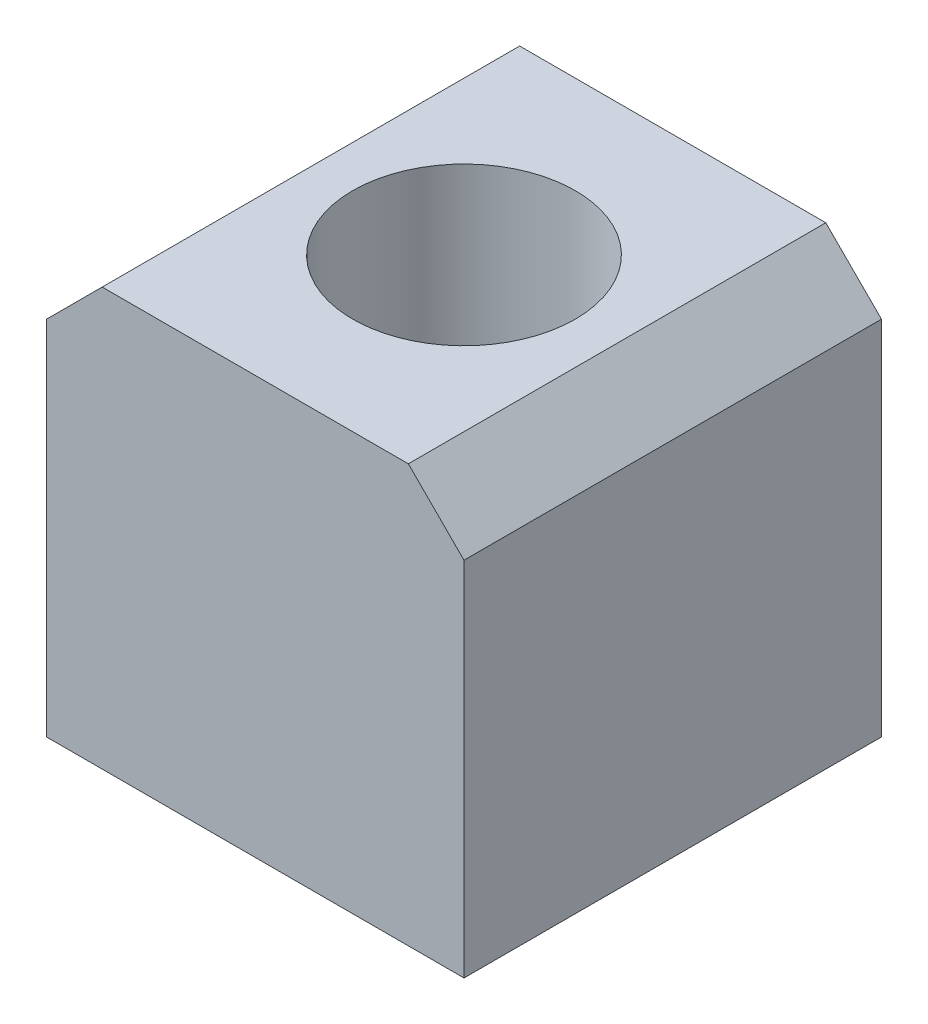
ISO-10303-21;
HEADER;
FILE_DESCRIPTION(('STEP AP214'),'2;1');
FILE_NAME('part.step','',(''),(''),'','','');
FILE_SCHEMA(('AUTOMOTIVE_DESIGN { 1 0 10303 214 1 1 1 1 }'));
ENDSEC;
DATA;
#1=APPLICATION_CONTEXT('core data for automotive mechanical design processes');
#2=APPLICATION_PROTOCOL_DEFINITION('international standard','automotive_design',2000,#1);
#3=PRODUCT_CONTEXT('',#1,'mechanical');
#4=PRODUCT('Part','Part','',(#3));
#5=PRODUCT_RELATED_PRODUCT_CATEGORY('part','',(#4));
#6=PRODUCT_DEFINITION_FORMATION('','',#4);
#7=PRODUCT_DEFINITION_CONTEXT('part definition',#1,'design');
#8=PRODUCT_DEFINITION('design','',#6,#7);
#9=PRODUCT_DEFINITION_SHAPE('','',#8);
#10=(LENGTH_UNIT() NAMED_UNIT(*) SI_UNIT(.MILLI.,.METRE.));
#11=(NAMED_UNIT(*) PLANE_ANGLE_UNIT() SI_UNIT($,.RADIAN.));
#12=(NAMED_UNIT(*) SI_UNIT($,.STERADIAN.) SOLID_ANGLE_UNIT());
#13=UNCERTAINTY_MEASURE_WITH_UNIT(LENGTH_MEASURE(1.E-05),#10,'distance_accuracy_value','');
#14=(GEOMETRIC_REPRESENTATION_CONTEXT(3) GLOBAL_UNCERTAINTY_ASSIGNED_CONTEXT((#13)) GLOBAL_UNIT_ASSIGNED_CONTEXT((#10,
#11,#12)) REPRESENTATION_CONTEXT('',''));
#15=CARTESIAN_POINT('',(0.,0.,0.));
#16=DIRECTION('',(0.,0.,1.));
#17=DIRECTION('',(1.,0.,0.));
#18=AXIS2_PLACEMENT_3D('',#15,#16,#17);
#19=CARTESIAN_POINT('',(-7.5,7.5,-7.5));
#20=DIRECTION('',(-1.,0.,0.));
#21=DIRECTION('',(0.,-1.,0.));
#22=AXIS2_PLACEMENT_3D('',#19,#20,#21);
#23=PLANE('',#22);
#24=DIRECTION('',(0.,-1.,0.));
#25=VECTOR('',#24,1.);
#26=CARTESIAN_POINT('',(-7.5,7.5,7.5));
#27=LINE('',#26,#25);
#28=CARTESIAN_POINT('',(-7.5,5.49999999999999,7.5));
#29=VERTEX_POINT('',#28);
#30=CARTESIAN_POINT('',(-7.5,-7.5,7.5));
#31=VERTEX_POINT('',#30);
#32=EDGE_CURVE('E100',#29,#31,#27,.T.);
#33=ORIENTED_EDGE('',*,*,#32,.F.);
#34=DIRECTION('',(0.,0.,-1.));
#35=VECTOR('',#34,1.);
#36=CARTESIAN_POINT('',(-7.5,5.49999999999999,-7.5));
#37=LINE('',#36,#35);
#38=CARTESIAN_POINT('',(-7.5,5.49999999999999,-7.5));
#39=VERTEX_POINT('',#38);
#40=EDGE_CURVE('E68',#29,#39,#37,.T.);
#41=ORIENTED_EDGE('',*,*,#40,.T.);
#42=DIRECTION('',(0.,-1.,0.));
#43=VECTOR('',#42,1.);
#44=CARTESIAN_POINT('',(-7.5,7.5,-7.5));
#45=LINE('',#44,#43);
#46=CARTESIAN_POINT('',(-7.5,-7.5,-7.5));
#47=VERTEX_POINT('',#46);
#48=EDGE_CURVE('E112',#39,#47,#45,.T.);
#49=ORIENTED_EDGE('',*,*,#48,.T.);
#50=DIRECTION('',(0.,0.,1.));
#51=VECTOR('',#50,1.);
#52=CARTESIAN_POINT('',(-7.5,-7.5,-7.5));
#53=LINE('',#52,#51);
#54=EDGE_CURVE('E111',#47,#31,#53,.T.);
#55=ORIENTED_EDGE('',*,*,#54,.T.);
#56=EDGE_LOOP('',(#33,#41,#49,#55));
#57=FACE_BOUND('',#56,.T.);
#58=ADVANCED_FACE('F44',(#57),#23,.T.);
#59=CARTESIAN_POINT('',(7.5,7.5,-7.5));
#60=DIRECTION('',(0.,1.,0.));
#61=DIRECTION('',(-1.,0.,0.));
#62=AXIS2_PLACEMENT_3D('',#59,#60,#61);
#63=PLANE('',#62);
#64=CARTESIAN_POINT('',(0.,7.5,0.));
#65=DIRECTION('',(0.,1.,0.));
#66=DIRECTION('',(-1.,0.,0.));
#67=AXIS2_PLACEMENT_3D('',#64,#65,#66);
#68=CIRCLE('',#67,4.);
#69=CARTESIAN_POINT('',(-4.,7.5,0.));
#70=VERTEX_POINT('',#69);
#71=EDGE_CURVE('E188',#70,#70,#68,.T.);
#72=ORIENTED_EDGE('',*,*,#71,.F.);
#73=EDGE_LOOP('',(#72));
#74=FACE_BOUND('',#73,.T.);
#75=DIRECTION('',(-1.,0.,0.));
#76=VECTOR('',#75,1.);
#77=CARTESIAN_POINT('',(7.5,7.5,-7.5));
#78=LINE('',#77,#76);
#79=CARTESIAN_POINT('',(5.49999999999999,7.5,-7.5));
#80=VERTEX_POINT('',#79);
#81=CARTESIAN_POINT('',(-5.49999999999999,7.5,-7.5));
#82=VERTEX_POINT('',#81);
#83=EDGE_CURVE('E117',#80,#82,#78,.T.);
#84=ORIENTED_EDGE('',*,*,#83,.T.);
#85=DIRECTION('',(0.,0.,1.));
#86=VECTOR('',#85,1.);
#87=CARTESIAN_POINT('',(-5.5,7.5,-7.5));
#88=LINE('',#87,#86);
#89=CARTESIAN_POINT('',(-5.49999999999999,7.5,7.5));
#90=VERTEX_POINT('',#89);
#91=EDGE_CURVE('E137',#82,#90,#88,.T.);
#92=ORIENTED_EDGE('',*,*,#91,.T.);
#93=DIRECTION('',(-1.,0.,0.));
#94=VECTOR('',#93,1.);
#95=CARTESIAN_POINT('',(7.5,7.5,7.5));
#96=LINE('',#95,#94);
#97=CARTESIAN_POINT('',(5.49999999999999,7.5,7.5));
#98=VERTEX_POINT('',#97);
#99=EDGE_CURVE('E122',#98,#90,#96,.T.);
#100=ORIENTED_EDGE('',*,*,#99,.F.);
#101=DIRECTION('',(0.,0.,-1.));
#102=VECTOR('',#101,1.);
#103=CARTESIAN_POINT('',(5.49999999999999,7.5,-7.5));
#104=LINE('',#103,#102);
#105=EDGE_CURVE('E134',#98,#80,#104,.T.);
#106=ORIENTED_EDGE('',*,*,#105,.T.);
#107=EDGE_LOOP('',(#84,#92,#100,#106));
#108=FACE_BOUND('',#107,.T.);
#109=ADVANCED_FACE('F150',(#74,#108),#63,.T.);
#110=CARTESIAN_POINT('',(7.5,7.5,-7.5));
#111=DIRECTION('',(1.,0.,0.));
#112=DIRECTION('',(0.,1.,0.));
#113=AXIS2_PLACEMENT_3D('',#110,#111,#112);
#114=PLANE('',#113);
#115=DIRECTION('',(0.,1.,0.));
#116=VECTOR('',#115,1.);
#117=CARTESIAN_POINT('',(7.5,7.5,-7.5));
#118=LINE('',#117,#116);
#119=CARTESIAN_POINT('',(7.5,-7.5,-7.5));
#120=VERTEX_POINT('',#119);
#121=CARTESIAN_POINT('',(7.5,5.5,-7.5));
#122=VERTEX_POINT('',#121);
#123=EDGE_CURVE('E130',#120,#122,#118,.T.);
#124=ORIENTED_EDGE('',*,*,#123,.T.);
#125=DIRECTION('',(0.,0.,1.));
#126=VECTOR('',#125,1.);
#127=CARTESIAN_POINT('',(7.5,5.5,-7.5));
#128=LINE('',#127,#126);
#129=CARTESIAN_POINT('',(7.5,5.5,7.5));
#130=VERTEX_POINT('',#129);
#131=EDGE_CURVE('E13',#122,#130,#128,.T.);
#132=ORIENTED_EDGE('',*,*,#131,.T.);
#133=DIRECTION('',(0.,1.,0.));
#134=VECTOR('',#133,1.);
#135=CARTESIAN_POINT('',(7.5,7.5,7.5));
#136=LINE('',#135,#134);
#137=CARTESIAN_POINT('',(7.5,-7.5,7.5));
#138=VERTEX_POINT('',#137);
#139=EDGE_CURVE('E120',#138,#130,#136,.T.);
#140=ORIENTED_EDGE('',*,*,#139,.F.);
#141=DIRECTION('',(0.,0.,1.));
#142=VECTOR('',#141,1.);
#143=CARTESIAN_POINT('',(7.5,-7.5,-7.5));
#144=LINE('',#143,#142);
#145=EDGE_CURVE('E116',#120,#138,#144,.T.);
#146=ORIENTED_EDGE('',*,*,#145,.F.);
#147=EDGE_LOOP('',(#124,#132,#140,#146));
#148=FACE_BOUND('',#147,.T.);
#149=ADVANCED_FACE('F167',(#148),#114,.T.);
#150=CARTESIAN_POINT('',(7.5,-7.5,-7.5));
#151=DIRECTION('',(0.,-1.,0.));
#152=DIRECTION('',(1.,0.,0.));
#153=AXIS2_PLACEMENT_3D('',#150,#151,#152);
#154=PLANE('',#153);
#155=CARTESIAN_POINT('',(0.,-7.5,0.));
#156=DIRECTION('',(0.,-1.,0.));
#157=DIRECTION('',(1.,0.,0.));
#158=AXIS2_PLACEMENT_3D('',#155,#156,#157);
#159=CIRCLE('',#158,4.);
#160=CARTESIAN_POINT('',(4.,-7.5,0.));
#161=VERTEX_POINT('',#160);
#162=EDGE_CURVE('E48',#161,#161,#159,.T.);
#163=ORIENTED_EDGE('',*,*,#162,.F.);
#164=EDGE_LOOP('',(#163));
#165=FACE_BOUND('',#164,.T.);
#166=ORIENTED_EDGE('',*,*,#145,.T.);
#167=DIRECTION('',(1.,0.,0.));
#168=VECTOR('',#167,1.);
#169=CARTESIAN_POINT('',(7.5,-7.5,7.5));
#170=LINE('',#169,#168);
#171=EDGE_CURVE('E106',#31,#138,#170,.T.);
#172=ORIENTED_EDGE('',*,*,#171,.F.);
#173=ORIENTED_EDGE('',*,*,#54,.F.);
#174=DIRECTION('',(1.,0.,0.));
#175=VECTOR('',#174,1.);
#176=CARTESIAN_POINT('',(7.5,-7.5,-7.5));
#177=LINE('',#176,#175);
#178=EDGE_CURVE('E128',#47,#120,#177,.T.);
#179=ORIENTED_EDGE('',*,*,#178,.T.);
#180=EDGE_LOOP('',(#166,#172,#173,#179));
#181=FACE_BOUND('',#180,.T.);
#182=ADVANCED_FACE('F119',(#165,#181),#154,.T.);
#183=CARTESIAN_POINT('',(0.,0.,-7.5));
#184=DIRECTION('',(0.,0.,-1.));
#185=DIRECTION('',(-1.,0.,0.));
#186=AXIS2_PLACEMENT_3D('',#183,#184,#185);
#187=PLANE('',#186);
#188=ORIENTED_EDGE('',*,*,#48,.F.);
#189=DIRECTION('',(-0.707106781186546,-0.707106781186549,0.));
#190=VECTOR('',#189,1.);
#191=CARTESIAN_POINT('',(-6.50000000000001,6.49999999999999,-7.5));
#192=LINE('',#191,#190);
#193=EDGE_CURVE('E53',#39,#82,#192,.F.);
#194=ORIENTED_EDGE('',*,*,#193,.T.);
#195=ORIENTED_EDGE('',*,*,#83,.F.);
#196=DIRECTION('',(-0.707106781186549,0.707106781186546,0.));
#197=VECTOR('',#196,1.);
#198=CARTESIAN_POINT('',(6.49999999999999,6.50000000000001,-7.5));
#199=LINE('',#198,#197);
#200=EDGE_CURVE('E60',#80,#122,#199,.F.);
#201=ORIENTED_EDGE('',*,*,#200,.T.);
#202=ORIENTED_EDGE('',*,*,#123,.F.);
#203=ORIENTED_EDGE('',*,*,#178,.F.);
#204=EDGE_LOOP('',(#188,#194,#195,#201,#202,#203));
#205=FACE_BOUND('',#204,.T.);
#206=ADVANCED_FACE('F146',(#205),#187,.T.);
#207=CARTESIAN_POINT('',(0.,0.,7.5));
#208=DIRECTION('',(0.,0.,-1.));
#209=DIRECTION('',(-1.,0.,0.));
#210=AXIS2_PLACEMENT_3D('',#207,#208,#209);
#211=PLANE('',#210);
#212=ORIENTED_EDGE('',*,*,#99,.T.);
#213=DIRECTION('',(0.707106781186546,0.707106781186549,0.));
#214=VECTOR('',#213,1.);
#215=CARTESIAN_POINT('',(-5.5,7.5,7.5));
#216=LINE('',#215,#214);
#217=EDGE_CURVE('E108',#90,#29,#216,.F.);
#218=ORIENTED_EDGE('',*,*,#217,.T.);
#219=ORIENTED_EDGE('',*,*,#32,.T.);
#220=ORIENTED_EDGE('',*,*,#171,.T.);
#221=ORIENTED_EDGE('',*,*,#139,.T.);
#222=DIRECTION('',(0.707106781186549,-0.707106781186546,0.));
#223=VECTOR('',#222,1.);
#224=CARTESIAN_POINT('',(7.5,5.5,7.5));
#225=LINE('',#224,#223);
#226=EDGE_CURVE('E140',#130,#98,#225,.F.);
#227=ORIENTED_EDGE('',*,*,#226,.T.);
#228=EDGE_LOOP('',(#212,#218,#219,#220,#221,#227));
#229=FACE_BOUND('',#228,.T.);
#230=ADVANCED_FACE('F103',(#229),#211,.F.);
#231=CARTESIAN_POINT('',(-5.5,7.5,-7.5));
#232=DIRECTION('',(0.707106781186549,-0.707106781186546,0.));
#233=DIRECTION('',(0.,0.,1.));
#234=AXIS2_PLACEMENT_3D('',#231,#232,#233);
#235=PLANE('',#234);
#236=ORIENTED_EDGE('',*,*,#193,.F.);
#237=ORIENTED_EDGE('',*,*,#40,.F.);
#238=ORIENTED_EDGE('',*,*,#217,.F.);
#239=ORIENTED_EDGE('',*,*,#91,.F.);
#240=EDGE_LOOP('',(#236,#237,#238,#239));
#241=FACE_BOUND('',#240,.T.);
#242=ADVANCED_FACE('F153',(#241),#235,.F.);
#243=CARTESIAN_POINT('',(7.5,5.5,-7.5));
#244=DIRECTION('',(-0.707106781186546,-0.707106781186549,0.));
#245=DIRECTION('',(0.,0.,1.));
#246=AXIS2_PLACEMENT_3D('',#243,#244,#245);
#247=PLANE('',#246);
#248=ORIENTED_EDGE('',*,*,#200,.F.);
#249=ORIENTED_EDGE('',*,*,#105,.F.);
#250=ORIENTED_EDGE('',*,*,#226,.F.);
#251=ORIENTED_EDGE('',*,*,#131,.F.);
#252=EDGE_LOOP('',(#248,#249,#250,#251));
#253=FACE_BOUND('',#252,.T.);
#254=ADVANCED_FACE('F46',(#253),#247,.F.);
#255=CARTESIAN_POINT('',(0.,-15.,0.));
#256=DIRECTION('',(0.,1.,0.));
#257=DIRECTION('',(-1.,0.,0.));
#258=AXIS2_PLACEMENT_3D('',#255,#256,#257);
#259=CYLINDRICAL_SURFACE('',#258,4.);
#260=ORIENTED_EDGE('',*,*,#162,.T.);
#261=EDGE_LOOP('',(#260));
#262=FACE_BOUND('',#261,.T.);
#263=ORIENTED_EDGE('',*,*,#71,.T.);
#264=EDGE_LOOP('',(#263));
#265=FACE_BOUND('',#264,.T.);
#266=ADVANCED_FACE('F159',(#262,#265),#259,.F.);
#267=CLOSED_SHELL('',(#58,#109,#149,#182,#206,#230,#242,#254,#266));
#268=MANIFOLD_SOLID_BREP('B2',#267);
#269=ADVANCED_BREP_SHAPE_REPRESENTATION('',(#18,#268),#14);
#270=SHAPE_DEFINITION_REPRESENTATION(#9,#269);
ENDSEC;
END-ISO-10303-21;
